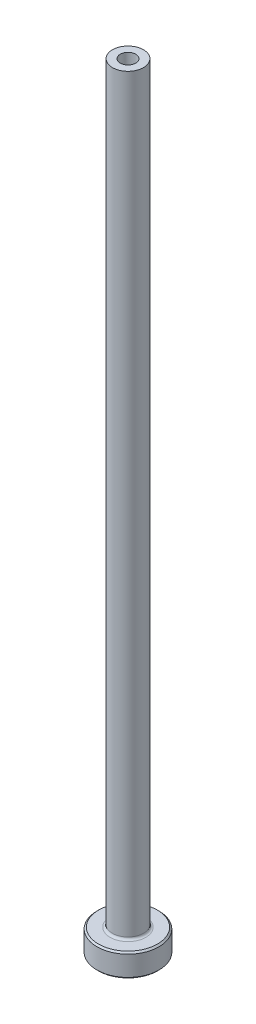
ISO-10303-21;
HEADER;
FILE_DESCRIPTION(('STEP AP214'),'2;1');
FILE_NAME('part.step','',(''),(''),'','','');
FILE_SCHEMA(('AUTOMOTIVE_DESIGN { 1 0 10303 214 1 1 1 1 }'));
ENDSEC;
DATA;
#1=APPLICATION_CONTEXT('core data for automotive mechanical design processes');
#2=APPLICATION_PROTOCOL_DEFINITION('international standard','automotive_design',2000,#1);
#3=PRODUCT_CONTEXT('',#1,'mechanical');
#4=PRODUCT('Part','Part','',(#3));
#5=PRODUCT_RELATED_PRODUCT_CATEGORY('part','',(#4));
#6=PRODUCT_DEFINITION_FORMATION('','',#4);
#7=PRODUCT_DEFINITION_CONTEXT('part definition',#1,'design');
#8=PRODUCT_DEFINITION('design','',#6,#7);
#9=PRODUCT_DEFINITION_SHAPE('','',#8);
#10=(LENGTH_UNIT() NAMED_UNIT(*) SI_UNIT(.MILLI.,.METRE.));
#11=(NAMED_UNIT(*) PLANE_ANGLE_UNIT() SI_UNIT($,.RADIAN.));
#12=(NAMED_UNIT(*) SI_UNIT($,.STERADIAN.) SOLID_ANGLE_UNIT());
#13=UNCERTAINTY_MEASURE_WITH_UNIT(LENGTH_MEASURE(1.E-05),#10,'distance_accuracy_value','');
#14=(GEOMETRIC_REPRESENTATION_CONTEXT(3) GLOBAL_UNCERTAINTY_ASSIGNED_CONTEXT((#13)) GLOBAL_UNIT_ASSIGNED_CONTEXT((#10,
#11,#12)) REPRESENTATION_CONTEXT('',''));
#15=CARTESIAN_POINT('',(0.,0.,0.));
#16=DIRECTION('',(0.,0.,1.));
#17=DIRECTION('',(1.,0.,0.));
#18=AXIS2_PLACEMENT_3D('',#15,#16,#17);
#19=CARTESIAN_POINT('',(0.,92.1876809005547,0.));
#20=DIRECTION('',(0.,1.,0.));
#21=DIRECTION('',(0.,0.,1.));
#22=AXIS2_PLACEMENT_3D('',#19,#20,#21);
#23=CYLINDRICAL_SURFACE('',#22,0.999999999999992);
#24=CARTESIAN_POINT('',(0.,100.,0.));
#25=DIRECTION('',(0.,1.,0.));
#26=DIRECTION('',(0.,0.,1.));
#27=AXIS2_PLACEMENT_3D('',#24,#25,#26);
#28=CIRCLE('',#27,0.999999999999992);
#29=CARTESIAN_POINT('',(0.,100.,0.999999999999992));
#30=VERTEX_POINT('',#29);
#31=EDGE_CURVE('E62',#30,#30,#28,.T.);
#32=ORIENTED_EDGE('',*,*,#31,.T.);
#33=EDGE_LOOP('',(#32));
#34=FACE_BOUND('',#33,.T.);
#35=CARTESIAN_POINT('',(0.,65.,0.));
#36=DIRECTION('',(0.,1.,0.));
#37=DIRECTION('',(0.,0.,1.));
#38=AXIS2_PLACEMENT_3D('',#35,#36,#37);
#39=CIRCLE('',#38,0.999999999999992);
#40=CARTESIAN_POINT('',(0.,65.,0.999999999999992));
#41=VERTEX_POINT('',#40);
#42=EDGE_CURVE('E71',#41,#41,#39,.T.);
#43=ORIENTED_EDGE('',*,*,#42,.F.);
#44=EDGE_LOOP('',(#43));
#45=FACE_BOUND('',#44,.T.);
#46=ADVANCED_FACE('F30',(#34,#45),#23,.F.);
#47=CARTESIAN_POINT('',(-0.999999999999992,100.,0.));
#48=DIRECTION('',(0.,1.,0.));
#49=DIRECTION('',(0.,0.,1.));
#50=AXIS2_PLACEMENT_3D('',#47,#48,#49);
#51=PLANE('',#50);
#52=CARTESIAN_POINT('',(0.,100.,0.));
#53=DIRECTION('',(0.,1.,0.));
#54=DIRECTION('',(0.,0.,1.));
#55=AXIS2_PLACEMENT_3D('',#52,#53,#54);
#56=CIRCLE('',#55,2.);
#57=CARTESIAN_POINT('',(0.,100.,2.));
#58=VERTEX_POINT('',#57);
#59=EDGE_CURVE('E65',#58,#58,#56,.T.);
#60=ORIENTED_EDGE('',*,*,#59,.T.);
#61=EDGE_LOOP('',(#60));
#62=FACE_BOUND('',#61,.T.);
#63=ORIENTED_EDGE('',*,*,#31,.F.);
#64=EDGE_LOOP('',(#63));
#65=FACE_BOUND('',#64,.T.);
#66=ADVANCED_FACE('F79',(#62,#65),#51,.T.);
#67=CARTESIAN_POINT('',(0.,92.1876809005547,0.));
#68=DIRECTION('',(0.,1.,0.));
#69=DIRECTION('',(0.,0.,1.));
#70=AXIS2_PLACEMENT_3D('',#67,#68,#69);
#71=CYLINDRICAL_SURFACE('',#70,1.99999999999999);
#72=CARTESIAN_POINT('',(0.,3.3,0.));
#73=DIRECTION('',(0.,1.,0.));
#74=DIRECTION('',(0.,0.,1.));
#75=AXIS2_PLACEMENT_3D('',#72,#73,#74);
#76=CIRCLE('',#75,1.99999999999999);
#77=CARTESIAN_POINT('',(0.,3.3,1.99999999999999));
#78=VERTEX_POINT('',#77);
#79=EDGE_CURVE('E59',#78,#78,#76,.T.);
#80=ORIENTED_EDGE('',*,*,#79,.T.);
#81=EDGE_LOOP('',(#80));
#82=FACE_BOUND('',#81,.T.);
#83=ORIENTED_EDGE('',*,*,#59,.F.);
#84=EDGE_LOOP('',(#83));
#85=FACE_BOUND('',#84,.T.);
#86=ADVANCED_FACE('F85',(#82,#85),#71,.T.);
#87=CARTESIAN_POINT('',(-1.99999999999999,3.,0.));
#88=DIRECTION('',(0.,1.,0.));
#89=DIRECTION('',(0.,0.,1.));
#90=AXIS2_PLACEMENT_3D('',#87,#88,#89);
#91=PLANE('',#90);
#92=CARTESIAN_POINT('',(0.,3.,0.));
#93=DIRECTION('',(0.,1.,0.));
#94=DIRECTION('',(0.,0.,1.));
#95=AXIS2_PLACEMENT_3D('',#92,#93,#94);
#96=CIRCLE('',#95,3.8);
#97=CARTESIAN_POINT('',(0.,3.,3.8));
#98=VERTEX_POINT('',#97);
#99=EDGE_CURVE('E53',#98,#98,#96,.T.);
#100=ORIENTED_EDGE('',*,*,#99,.T.);
#101=EDGE_LOOP('',(#100));
#102=FACE_BOUND('',#101,.T.);
#103=CARTESIAN_POINT('',(0.,3.,0.));
#104=DIRECTION('',(0.,1.,0.));
#105=DIRECTION('',(0.,0.,1.));
#106=AXIS2_PLACEMENT_3D('',#103,#104,#105);
#107=CIRCLE('',#106,2.29999999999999);
#108=CARTESIAN_POINT('',(0.,3.,2.29999999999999));
#109=VERTEX_POINT('',#108);
#110=EDGE_CURVE('E56',#109,#109,#107,.F.);
#111=ORIENTED_EDGE('',*,*,#110,.T.);
#112=EDGE_LOOP('',(#111));
#113=FACE_BOUND('',#112,.T.);
#114=ADVANCED_FACE('F111',(#102,#113),#91,.T.);
#115=CARTESIAN_POINT('',(0.,92.1876809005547,0.));
#116=DIRECTION('',(0.,1.,0.));
#117=DIRECTION('',(0.,0.,1.));
#118=AXIS2_PLACEMENT_3D('',#115,#116,#117);
#119=CYLINDRICAL_SURFACE('',#118,3.99999999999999);
#120=CARTESIAN_POINT('',(0.,2.8,0.));
#121=DIRECTION('',(0.,1.,0.));
#122=DIRECTION('',(0.,0.,1.));
#123=AXIS2_PLACEMENT_3D('',#120,#121,#122);
#124=CIRCLE('',#123,3.99999999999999);
#125=CARTESIAN_POINT('',(0.,2.8,3.99999999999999));
#126=VERTEX_POINT('',#125);
#127=EDGE_CURVE('E45',#126,#126,#124,.F.);
#128=ORIENTED_EDGE('',*,*,#127,.T.);
#129=EDGE_LOOP('',(#128));
#130=FACE_BOUND('',#129,.T.);
#131=CARTESIAN_POINT('',(0.,0.20000000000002,0.));
#132=DIRECTION('',(0.,-1.,0.));
#133=DIRECTION('',(0.,0.,-1.));
#134=AXIS2_PLACEMENT_3D('',#131,#132,#133);
#135=CIRCLE('',#134,3.99999999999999);
#136=CARTESIAN_POINT('',(0.,0.20000000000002,-3.99999999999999));
#137=VERTEX_POINT('',#136);
#138=EDGE_CURVE('E50',#137,#137,#135,.F.);
#139=ORIENTED_EDGE('',*,*,#138,.T.);
#140=EDGE_LOOP('',(#139));
#141=FACE_BOUND('',#140,.T.);
#142=ADVANCED_FACE('F108',(#130,#141),#119,.T.);
#143=CARTESIAN_POINT('',(-3.99999999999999,0.,0.));
#144=DIRECTION('',(0.,-1.,0.));
#145=DIRECTION('',(0.,0.,-1.));
#146=AXIS2_PLACEMENT_3D('',#143,#144,#145);
#147=PLANE('',#146);
#148=CARTESIAN_POINT('',(0.,0.,0.));
#149=DIRECTION('',(0.,-1.,0.));
#150=DIRECTION('',(0.,0.,-1.));
#151=AXIS2_PLACEMENT_3D('',#148,#149,#150);
#152=CIRCLE('',#151,1.74999999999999);
#153=CARTESIAN_POINT('',(0.,0.,-1.74999999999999));
#154=VERTEX_POINT('',#153);
#155=EDGE_CURVE('E37',#154,#154,#152,.F.);
#156=ORIENTED_EDGE('',*,*,#155,.T.);
#157=EDGE_LOOP('',(#156));
#158=FACE_BOUND('',#157,.T.);
#159=CARTESIAN_POINT('',(0.,0.,0.));
#160=DIRECTION('',(0.,-1.,0.));
#161=DIRECTION('',(0.,0.,-1.));
#162=AXIS2_PLACEMENT_3D('',#159,#160,#161);
#163=CIRCLE('',#162,3.79999999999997);
#164=CARTESIAN_POINT('',(0.,0.,-3.79999999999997));
#165=VERTEX_POINT('',#164);
#166=EDGE_CURVE('E41',#165,#165,#163,.T.);
#167=ORIENTED_EDGE('',*,*,#166,.T.);
#168=EDGE_LOOP('',(#167));
#169=FACE_BOUND('',#168,.T.);
#170=ADVANCED_FACE('F110',(#158,#169),#147,.T.);
#171=CARTESIAN_POINT('',(0.,92.1876809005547,0.));
#172=DIRECTION('',(0.,1.,0.));
#173=DIRECTION('',(0.,0.,1.));
#174=AXIS2_PLACEMENT_3D('',#171,#172,#173);
#175=CYLINDRICAL_SURFACE('',#174,1.24999999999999);
#176=CARTESIAN_POINT('',(0.,0.499999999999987,0.));
#177=DIRECTION('',(0.,-1.,0.));
#178=DIRECTION('',(0.,0.,-1.));
#179=AXIS2_PLACEMENT_3D('',#176,#177,#178);
#180=CIRCLE('',#179,1.24999999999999);
#181=CARTESIAN_POINT('',(0.,0.499999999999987,-1.24999999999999));
#182=VERTEX_POINT('',#181);
#183=EDGE_CURVE('E10',#182,#182,#180,.T.);
#184=ORIENTED_EDGE('',*,*,#183,.T.);
#185=EDGE_LOOP('',(#184));
#186=FACE_BOUND('',#185,.T.);
#187=CARTESIAN_POINT('',(0.,53.,0.));
#188=DIRECTION('',(0.,1.,0.));
#189=DIRECTION('',(0.,0.,1.));
#190=AXIS2_PLACEMENT_3D('',#187,#188,#189);
#191=CIRCLE('',#190,1.25);
#192=CARTESIAN_POINT('',(0.,53.,1.25));
#193=VERTEX_POINT('',#192);
#194=EDGE_CURVE('E68',#193,#193,#191,.T.);
#195=ORIENTED_EDGE('',*,*,#194,.T.);
#196=EDGE_LOOP('',(#195));
#197=FACE_BOUND('',#196,.T.);
#198=ADVANCED_FACE('F118',(#186,#197),#175,.F.);
#199=CARTESIAN_POINT('',(0.,53.,0.));
#200=DIRECTION('',(0.,-1.,0.));
#201=DIRECTION('',(0.,0.,-1.));
#202=AXIS2_PLACEMENT_3D('',#199,#200,#201);
#203=CONICAL_SURFACE('',#202,1.25,0.0208303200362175);
#204=ORIENTED_EDGE('',*,*,#42,.T.);
#205=EDGE_LOOP('',(#204));
#206=FACE_BOUND('',#205,.T.);
#207=ORIENTED_EDGE('',*,*,#194,.F.);
#208=EDGE_LOOP('',(#207));
#209=FACE_BOUND('',#208,.T.);
#210=ADVANCED_FACE('F75',(#206,#209),#203,.F.);
#211=CARTESIAN_POINT('',(0.,3.3,0.));
#212=DIRECTION('',(0.,1.,0.));
#213=DIRECTION('',(0.,0.,1.));
#214=AXIS2_PLACEMENT_3D('',#211,#212,#213);
#215=TOROIDAL_SURFACE('',#214,2.29999999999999,0.3);
#216=ORIENTED_EDGE('',*,*,#110,.F.);
#217=EDGE_LOOP('',(#216));
#218=FACE_BOUND('',#217,.T.);
#219=ORIENTED_EDGE('',*,*,#79,.F.);
#220=EDGE_LOOP('',(#219));
#221=FACE_BOUND('',#220,.T.);
#222=ADVANCED_FACE('F90',(#218,#221),#215,.F.);
#223=CARTESIAN_POINT('',(0.,3.,0.));
#224=DIRECTION('',(0.,-1.,0.));
#225=DIRECTION('',(0.,0.,-1.));
#226=AXIS2_PLACEMENT_3D('',#223,#224,#225);
#227=CONICAL_SURFACE('',#226,3.8,0.785398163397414);
#228=ORIENTED_EDGE('',*,*,#127,.F.);
#229=EDGE_LOOP('',(#228));
#230=FACE_BOUND('',#229,.T.);
#231=ORIENTED_EDGE('',*,*,#99,.F.);
#232=EDGE_LOOP('',(#231));
#233=FACE_BOUND('',#232,.T.);
#234=ADVANCED_FACE('F93',(#230,#233),#227,.T.);
#235=CARTESIAN_POINT('',(0.,0.20000000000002,0.));
#236=DIRECTION('',(0.,1.,0.));
#237=DIRECTION('',(0.,0.,1.));
#238=AXIS2_PLACEMENT_3D('',#235,#236,#237);
#239=CONICAL_SURFACE('',#238,3.99999999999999,0.785398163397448);
#240=ORIENTED_EDGE('',*,*,#166,.F.);
#241=EDGE_LOOP('',(#240));
#242=FACE_BOUND('',#241,.T.);
#243=ORIENTED_EDGE('',*,*,#138,.F.);
#244=EDGE_LOOP('',(#243));
#245=FACE_BOUND('',#244,.T.);
#246=ADVANCED_FACE('F96',(#242,#245),#239,.T.);
#247=CARTESIAN_POINT('',(0.,0.,0.));
#248=DIRECTION('',(0.,-1.,0.));
#249=DIRECTION('',(0.,0.,-1.));
#250=AXIS2_PLACEMENT_3D('',#247,#248,#249);
#251=CONICAL_SURFACE('',#250,1.74999999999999,0.785398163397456);
#252=ORIENTED_EDGE('',*,*,#183,.F.);
#253=EDGE_LOOP('',(#252));
#254=FACE_BOUND('',#253,.T.);
#255=ORIENTED_EDGE('',*,*,#155,.F.);
#256=EDGE_LOOP('',(#255));
#257=FACE_BOUND('',#256,.T.);
#258=ADVANCED_FACE('F32',(#254,#257),#251,.F.);
#259=CLOSED_SHELL('',(#46,#66,#86,#114,#142,#170,#198,#210,#222,#234,#246,#258));
#260=MANIFOLD_SOLID_BREP('B2',#259);
#261=ADVANCED_BREP_SHAPE_REPRESENTATION('',(#18,#260),#14);
#262=SHAPE_DEFINITION_REPRESENTATION(#9,#261);
ENDSEC;
END-ISO-10303-21;
